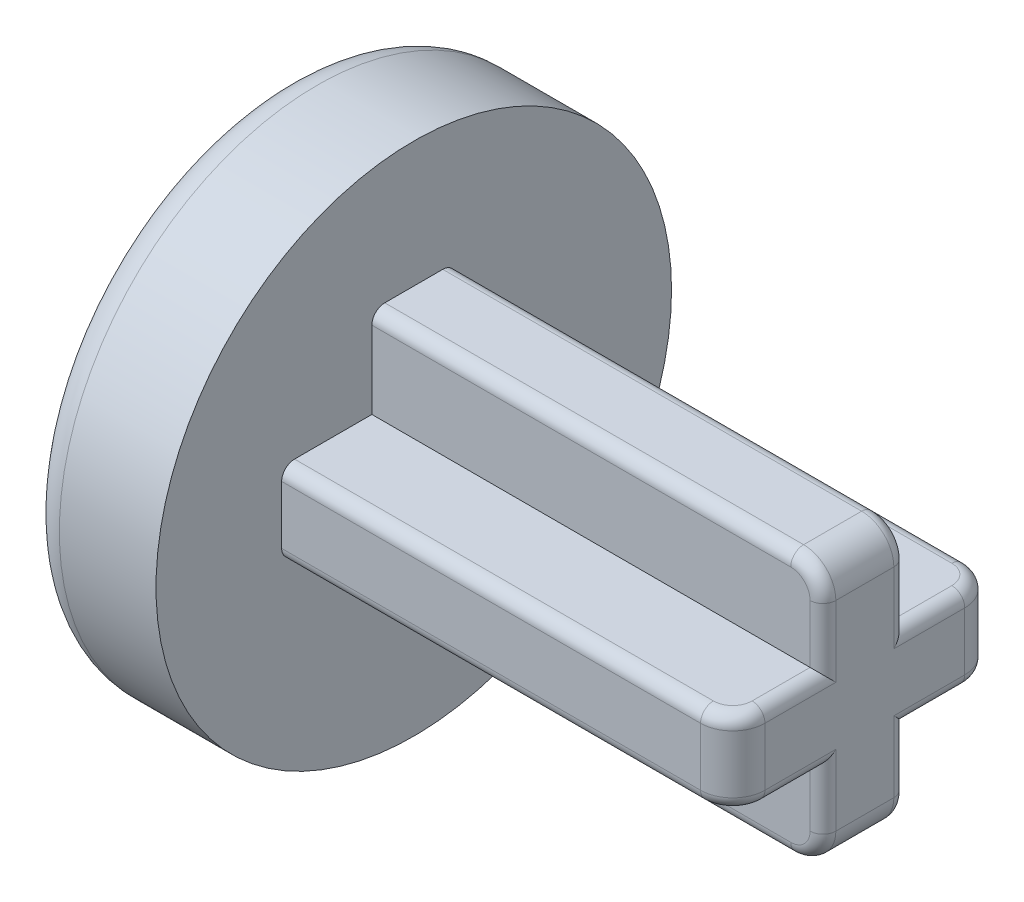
ISO-10303-21;
HEADER;
FILE_DESCRIPTION(('STEP AP214'),'2;1');
FILE_NAME('part.step','',(''),(''),'','','');
FILE_SCHEMA(('AUTOMOTIVE_DESIGN { 1 0 10303 214 1 1 1 1 }'));
ENDSEC;
DATA;
#1=APPLICATION_CONTEXT('core data for automotive mechanical design processes');
#2=APPLICATION_PROTOCOL_DEFINITION('international standard','automotive_design',2000,#1);
#3=PRODUCT_CONTEXT('',#1,'mechanical');
#4=PRODUCT('Part','Part','',(#3));
#5=PRODUCT_RELATED_PRODUCT_CATEGORY('part','',(#4));
#6=PRODUCT_DEFINITION_FORMATION('','',#4);
#7=PRODUCT_DEFINITION_CONTEXT('part definition',#1,'design');
#8=PRODUCT_DEFINITION('design','',#6,#7);
#9=PRODUCT_DEFINITION_SHAPE('','',#8);
#10=(LENGTH_UNIT() NAMED_UNIT(*) SI_UNIT(.MILLI.,.METRE.));
#11=(NAMED_UNIT(*) PLANE_ANGLE_UNIT() SI_UNIT($,.RADIAN.));
#12=(NAMED_UNIT(*) SI_UNIT($,.STERADIAN.) SOLID_ANGLE_UNIT());
#13=UNCERTAINTY_MEASURE_WITH_UNIT(LENGTH_MEASURE(1.E-05),#10,'distance_accuracy_value','');
#14=(GEOMETRIC_REPRESENTATION_CONTEXT(3) GLOBAL_UNCERTAINTY_ASSIGNED_CONTEXT((#13)) GLOBAL_UNIT_ASSIGNED_CONTEXT((#10,
#11,#12)) REPRESENTATION_CONTEXT('',''));
#15=CARTESIAN_POINT('',(0.,0.,0.));
#16=DIRECTION('',(0.,0.,1.));
#17=DIRECTION('',(1.,0.,0.));
#18=AXIS2_PLACEMENT_3D('',#15,#16,#17);
#19=CARTESIAN_POINT('',(2.,0.,0.));
#20=DIRECTION('',(1.,0.,0.));
#21=DIRECTION('',(0.,0.,-1.));
#22=AXIS2_PLACEMENT_3D('',#19,#20,#21);
#23=PLANE('',#22);
#24=CARTESIAN_POINT('',(2.,0.,0.));
#25=DIRECTION('',(1.,0.,0.));
#26=DIRECTION('',(0.,0.,-1.));
#27=AXIS2_PLACEMENT_3D('',#24,#25,#26);
#28=CIRCLE('',#27,4.);
#29=CARTESIAN_POINT('',(2.,0.,-4.));
#30=VERTEX_POINT('',#29);
#31=EDGE_CURVE('E242',#30,#30,#28,.T.);
#32=ORIENTED_EDGE('',*,*,#31,.T.);
#33=EDGE_LOOP('',(#32));
#34=FACE_BOUND('',#33,.T.);
#35=DIRECTION('',(0.,0.,1.));
#36=VECTOR('',#35,1.);
#37=CARTESIAN_POINT('',(2.,0.65,2.05));
#38=LINE('',#37,#36);
#39=CARTESIAN_POINT('',(2.,0.65,0.65));
#40=VERTEX_POINT('',#39);
#41=CARTESIAN_POINT('',(2.,0.65,1.85));
#42=VERTEX_POINT('',#41);
#43=EDGE_CURVE('E237',#40,#42,#38,.T.);
#44=ORIENTED_EDGE('',*,*,#43,.F.);
#45=DIRECTION('',(0.,-1.,0.));
#46=VECTOR('',#45,1.);
#47=CARTESIAN_POINT('',(2.,0.65,0.65));
#48=LINE('',#47,#46);
#49=CARTESIAN_POINT('',(2.,1.85,0.65));
#50=VERTEX_POINT('',#49);
#51=EDGE_CURVE('E246',#50,#40,#48,.T.);
#52=ORIENTED_EDGE('',*,*,#51,.F.);
#53=CARTESIAN_POINT('',(2.,1.85,0.45));
#54=DIRECTION('',(1.,0.,0.));
#55=DIRECTION('',(0.,0.,-1.));
#56=AXIS2_PLACEMENT_3D('',#53,#54,#55);
#57=CIRCLE('',#56,0.2);
#58=CARTESIAN_POINT('',(2.,2.05,0.45));
#59=VERTEX_POINT('',#58);
#60=EDGE_CURVE('E337',#50,#59,#57,.F.);
#61=ORIENTED_EDGE('',*,*,#60,.T.);
#62=DIRECTION('',(0.,0.,1.));
#63=VECTOR('',#62,1.);
#64=CARTESIAN_POINT('',(2.,2.05,0.65));
#65=LINE('',#64,#63);
#66=CARTESIAN_POINT('',(2.,2.05,-0.45));
#67=VERTEX_POINT('',#66);
#68=EDGE_CURVE('E286',#67,#59,#65,.T.);
#69=ORIENTED_EDGE('',*,*,#68,.F.);
#70=CARTESIAN_POINT('',(2.,1.85,-0.45));
#71=DIRECTION('',(1.,0.,0.));
#72=DIRECTION('',(0.,0.,-1.));
#73=AXIS2_PLACEMENT_3D('',#70,#71,#72);
#74=CIRCLE('',#73,0.2);
#75=CARTESIAN_POINT('',(2.,1.85,-0.65));
#76=VERTEX_POINT('',#75);
#77=EDGE_CURVE('E339',#67,#76,#74,.F.);
#78=ORIENTED_EDGE('',*,*,#77,.T.);
#79=DIRECTION('',(0.,1.,0.));
#80=VECTOR('',#79,1.);
#81=CARTESIAN_POINT('',(2.,2.05,-0.65));
#82=LINE('',#81,#80);
#83=CARTESIAN_POINT('',(2.,0.65,-0.65));
#84=VERTEX_POINT('',#83);
#85=EDGE_CURVE('E283',#84,#76,#82,.T.);
#86=ORIENTED_EDGE('',*,*,#85,.F.);
#87=DIRECTION('',(0.,0.,1.));
#88=VECTOR('',#87,1.);
#89=CARTESIAN_POINT('',(2.,0.65,-0.65));
#90=LINE('',#89,#88);
#91=CARTESIAN_POINT('',(2.,0.65,-1.85));
#92=VERTEX_POINT('',#91);
#93=EDGE_CURVE('E280',#92,#84,#90,.T.);
#94=ORIENTED_EDGE('',*,*,#93,.F.);
#95=CARTESIAN_POINT('',(2.,0.45,-1.85));
#96=DIRECTION('',(1.,0.,0.));
#97=DIRECTION('',(0.,0.,-1.));
#98=AXIS2_PLACEMENT_3D('',#95,#96,#97);
#99=CIRCLE('',#98,0.2);
#100=CARTESIAN_POINT('',(2.,0.45,-2.05));
#101=VERTEX_POINT('',#100);
#102=EDGE_CURVE('E341',#92,#101,#99,.F.);
#103=ORIENTED_EDGE('',*,*,#102,.T.);
#104=DIRECTION('',(0.,1.,0.));
#105=VECTOR('',#104,1.);
#106=CARTESIAN_POINT('',(2.,0.65,-2.05));
#107=LINE('',#106,#105);
#108=CARTESIAN_POINT('',(2.,-0.45,-2.05));
#109=VERTEX_POINT('',#108);
#110=EDGE_CURVE('E277',#109,#101,#107,.T.);
#111=ORIENTED_EDGE('',*,*,#110,.F.);
#112=CARTESIAN_POINT('',(2.,-0.45,-1.85));
#113=DIRECTION('',(1.,0.,0.));
#114=DIRECTION('',(0.,0.,-1.));
#115=AXIS2_PLACEMENT_3D('',#112,#113,#114);
#116=CIRCLE('',#115,0.2);
#117=CARTESIAN_POINT('',(2.,-0.65,-1.85));
#118=VERTEX_POINT('',#117);
#119=EDGE_CURVE('E343',#109,#118,#116,.F.);
#120=ORIENTED_EDGE('',*,*,#119,.T.);
#121=DIRECTION('',(0.,0.,-1.));
#122=VECTOR('',#121,1.);
#123=CARTESIAN_POINT('',(2.,-0.65,-2.05));
#124=LINE('',#123,#122);
#125=CARTESIAN_POINT('',(2.,-0.65,-0.65));
#126=VERTEX_POINT('',#125);
#127=EDGE_CURVE('E274',#126,#118,#124,.T.);
#128=ORIENTED_EDGE('',*,*,#127,.F.);
#129=DIRECTION('',(0.,1.,0.));
#130=VECTOR('',#129,1.);
#131=CARTESIAN_POINT('',(2.,-0.65,-0.65));
#132=LINE('',#131,#130);
#133=CARTESIAN_POINT('',(2.,-1.85,-0.65));
#134=VERTEX_POINT('',#133);
#135=EDGE_CURVE('E271',#134,#126,#132,.T.);
#136=ORIENTED_EDGE('',*,*,#135,.F.);
#137=CARTESIAN_POINT('',(2.,-1.85,-0.45));
#138=DIRECTION('',(1.,0.,0.));
#139=DIRECTION('',(0.,0.,-1.));
#140=AXIS2_PLACEMENT_3D('',#137,#138,#139);
#141=CIRCLE('',#140,0.2);
#142=CARTESIAN_POINT('',(2.,-2.05,-0.45));
#143=VERTEX_POINT('',#142);
#144=EDGE_CURVE('E345',#134,#143,#141,.F.);
#145=ORIENTED_EDGE('',*,*,#144,.T.);
#146=DIRECTION('',(0.,0.,-1.));
#147=VECTOR('',#146,1.);
#148=CARTESIAN_POINT('',(2.,-2.05,-0.65));
#149=LINE('',#148,#147);
#150=CARTESIAN_POINT('',(2.,-2.05,0.45));
#151=VERTEX_POINT('',#150);
#152=EDGE_CURVE('E268',#151,#143,#149,.T.);
#153=ORIENTED_EDGE('',*,*,#152,.F.);
#154=CARTESIAN_POINT('',(2.,-1.85,0.45));
#155=DIRECTION('',(1.,0.,0.));
#156=DIRECTION('',(0.,0.,-1.));
#157=AXIS2_PLACEMENT_3D('',#154,#155,#156);
#158=CIRCLE('',#157,0.2);
#159=CARTESIAN_POINT('',(2.,-1.85,0.65));
#160=VERTEX_POINT('',#159);
#161=EDGE_CURVE('E347',#151,#160,#158,.F.);
#162=ORIENTED_EDGE('',*,*,#161,.T.);
#163=DIRECTION('',(0.,-1.,0.));
#164=VECTOR('',#163,1.);
#165=CARTESIAN_POINT('',(2.,-2.05,0.65));
#166=LINE('',#165,#164);
#167=CARTESIAN_POINT('',(2.,-0.65,0.65));
#168=VERTEX_POINT('',#167);
#169=EDGE_CURVE('E265',#168,#160,#166,.T.);
#170=ORIENTED_EDGE('',*,*,#169,.F.);
#171=DIRECTION('',(0.,0.,-1.));
#172=VECTOR('',#171,1.);
#173=CARTESIAN_POINT('',(2.,-0.65,0.65));
#174=LINE('',#173,#172);
#175=CARTESIAN_POINT('',(2.,-0.65,1.85));
#176=VERTEX_POINT('',#175);
#177=EDGE_CURVE('E260',#176,#168,#174,.T.);
#178=ORIENTED_EDGE('',*,*,#177,.F.);
#179=CARTESIAN_POINT('',(2.,-0.45,1.85));
#180=DIRECTION('',(1.,0.,0.));
#181=DIRECTION('',(0.,0.,-1.));
#182=AXIS2_PLACEMENT_3D('',#179,#180,#181);
#183=CIRCLE('',#182,0.2);
#184=CARTESIAN_POINT('',(2.,-0.45,2.05));
#185=VERTEX_POINT('',#184);
#186=EDGE_CURVE('E334',#176,#185,#183,.F.);
#187=ORIENTED_EDGE('',*,*,#186,.T.);
#188=DIRECTION('',(0.,-1.,0.));
#189=VECTOR('',#188,1.);
#190=CARTESIAN_POINT('',(2.,-0.65,2.05));
#191=LINE('',#190,#189);
#192=CARTESIAN_POINT('',(2.,0.45,2.05));
#193=VERTEX_POINT('',#192);
#194=EDGE_CURVE('E257',#193,#185,#191,.T.);
#195=ORIENTED_EDGE('',*,*,#194,.F.);
#196=CARTESIAN_POINT('',(2.,0.45,1.85));
#197=DIRECTION('',(1.,0.,0.));
#198=DIRECTION('',(0.,0.,-1.));
#199=AXIS2_PLACEMENT_3D('',#196,#197,#198);
#200=CIRCLE('',#199,0.2);
#201=EDGE_CURVE('E256',#193,#42,#200,.F.);
#202=ORIENTED_EDGE('',*,*,#201,.T.);
#203=EDGE_LOOP('',(#44,#52,#61,#69,#78,#86,#94,#103,#111,#120,#128,#136,#145,#153,#162,#170,
#178,#187,#195,#202));
#204=FACE_BOUND('',#203,.T.);
#205=ADVANCED_FACE('F35',(#34,#204),#23,.T.);
#206=CARTESIAN_POINT('',(2.,0.,0.));
#207=DIRECTION('',(-1.,0.,0.));
#208=DIRECTION('',(0.,0.,1.));
#209=AXIS2_PLACEMENT_3D('',#206,#207,#208);
#210=CYLINDRICAL_SURFACE('',#209,4.);
#211=CARTESIAN_POINT('',(0.5,0.,0.));
#212=DIRECTION('',(1.,0.,0.));
#213=DIRECTION('',(0.,0.,-1.));
#214=AXIS2_PLACEMENT_3D('',#211,#212,#213);
#215=CIRCLE('',#214,4.);
#216=CARTESIAN_POINT('',(0.5,0.,-4.));
#217=VERTEX_POINT('',#216);
#218=EDGE_CURVE('E43',#217,#217,#215,.T.);
#219=ORIENTED_EDGE('',*,*,#218,.T.);
#220=EDGE_LOOP('',(#219));
#221=FACE_BOUND('',#220,.T.);
#222=ORIENTED_EDGE('',*,*,#31,.F.);
#223=EDGE_LOOP('',(#222));
#224=FACE_BOUND('',#223,.T.);
#225=ADVANCED_FACE('F490',(#221,#224),#210,.T.);
#226=CARTESIAN_POINT('',(0.,0.,0.));
#227=DIRECTION('',(1.,0.,0.));
#228=DIRECTION('',(0.,0.,-1.));
#229=AXIS2_PLACEMENT_3D('',#226,#227,#228);
#230=PLANE('',#229);
#231=CARTESIAN_POINT('',(0.,0.,0.));
#232=DIRECTION('',(1.,0.,0.));
#233=DIRECTION('',(0.,0.,-1.));
#234=AXIS2_PLACEMENT_3D('',#231,#232,#233);
#235=CIRCLE('',#234,3.5);
#236=CARTESIAN_POINT('',(0.,0.,-3.5));
#237=VERTEX_POINT('',#236);
#238=EDGE_CURVE('E11',#237,#237,#235,.F.);
#239=ORIENTED_EDGE('',*,*,#238,.T.);
#240=EDGE_LOOP('',(#239));
#241=FACE_BOUND('',#240,.T.);
#242=ADVANCED_FACE('F509',(#241),#230,.F.);
#243=CARTESIAN_POINT('',(9.,0.65,0.65));
#244=DIRECTION('',(0.,0.,-1.));
#245=DIRECTION('',(-1.,0.,0.));
#246=AXIS2_PLACEMENT_3D('',#243,#244,#245);
#247=PLANE('',#246);
#248=DIRECTION('',(-1.,0.,0.));
#249=VECTOR('',#248,1.);
#250=CARTESIAN_POINT('',(9.,0.65,0.65));
#251=LINE('',#250,#249);
#252=CARTESIAN_POINT('',(8.8,0.65,0.65));
#253=VERTEX_POINT('',#252);
#254=EDGE_CURVE('E233',#253,#40,#251,.T.);
#255=ORIENTED_EDGE('',*,*,#254,.F.);
#256=DIRECTION('',(0.,-1.,0.));
#257=VECTOR('',#256,1.);
#258=CARTESIAN_POINT('',(8.8,0.65,0.65));
#259=LINE('',#258,#257);
#260=CARTESIAN_POINT('',(8.8,1.55,0.65));
#261=VERTEX_POINT('',#260);
#262=EDGE_CURVE('E392',#253,#261,#259,.F.);
#263=ORIENTED_EDGE('',*,*,#262,.T.);
#264=CARTESIAN_POINT('',(8.5,1.55,0.65));
#265=DIRECTION('',(0.,0.,-1.));
#266=DIRECTION('',(-1.,0.,0.));
#267=AXIS2_PLACEMENT_3D('',#264,#265,#266);
#268=CIRCLE('',#267,0.3);
#269=CARTESIAN_POINT('',(8.5,1.85,0.65));
#270=VERTEX_POINT('',#269);
#271=EDGE_CURVE('E390',#261,#270,#268,.F.);
#272=ORIENTED_EDGE('',*,*,#271,.T.);
#273=DIRECTION('',(-1.,0.,0.));
#274=VECTOR('',#273,1.);
#275=CARTESIAN_POINT('',(9.,1.85,0.65));
#276=LINE('',#275,#274);
#277=EDGE_CURVE('E249',#270,#50,#276,.T.);
#278=ORIENTED_EDGE('',*,*,#277,.T.);
#279=ORIENTED_EDGE('',*,*,#51,.T.);
#280=EDGE_LOOP('',(#255,#263,#272,#278,#279));
#281=FACE_BOUND('',#280,.T.);
#282=ADVANCED_FACE('F247',(#281),#247,.F.);
#283=CARTESIAN_POINT('',(9.,0.65,2.05));
#284=DIRECTION('',(0.,-1.,0.));
#285=DIRECTION('',(0.,0.,-1.));
#286=AXIS2_PLACEMENT_3D('',#283,#284,#285);
#287=PLANE('',#286);
#288=DIRECTION('',(-1.,0.,0.));
#289=VECTOR('',#288,1.);
#290=CARTESIAN_POINT('',(9.,0.65,1.85));
#291=LINE('',#290,#289);
#292=CARTESIAN_POINT('',(8.5,0.65,1.85));
#293=VERTEX_POINT('',#292);
#294=EDGE_CURVE('E303',#42,#293,#291,.F.);
#295=ORIENTED_EDGE('',*,*,#294,.T.);
#296=CARTESIAN_POINT('',(8.5,0.65,1.55));
#297=DIRECTION('',(0.,-1.,0.));
#298=DIRECTION('',(0.,0.,-1.));
#299=AXIS2_PLACEMENT_3D('',#296,#297,#298);
#300=CIRCLE('',#299,0.3);
#301=CARTESIAN_POINT('',(8.8,0.65,1.55));
#302=VERTEX_POINT('',#301);
#303=EDGE_CURVE('E50',#293,#302,#300,.F.);
#304=ORIENTED_EDGE('',*,*,#303,.T.);
#305=DIRECTION('',(0.,0.,1.));
#306=VECTOR('',#305,1.);
#307=CARTESIAN_POINT('',(8.8,0.65,2.05));
#308=LINE('',#307,#306);
#309=EDGE_CURVE('E239',#302,#253,#308,.F.);
#310=ORIENTED_EDGE('',*,*,#309,.T.);
#311=ORIENTED_EDGE('',*,*,#254,.T.);
#312=ORIENTED_EDGE('',*,*,#43,.T.);
#313=EDGE_LOOP('',(#295,#304,#310,#311,#312));
#314=FACE_BOUND('',#313,.T.);
#315=ADVANCED_FACE('F235',(#314),#287,.F.);
#316=CARTESIAN_POINT('',(9.,-0.65,2.05));
#317=DIRECTION('',(0.,0.,-1.));
#318=DIRECTION('',(-1.,0.,0.));
#319=AXIS2_PLACEMENT_3D('',#316,#317,#318);
#320=PLANE('',#319);
#321=DIRECTION('',(-1.,0.,0.));
#322=VECTOR('',#321,1.);
#323=CARTESIAN_POINT('',(9.,-0.45,2.05));
#324=LINE('',#323,#322);
#325=CARTESIAN_POINT('',(8.5,-0.45,2.05));
#326=VERTEX_POINT('',#325);
#327=EDGE_CURVE('E300',#185,#326,#324,.F.);
#328=ORIENTED_EDGE('',*,*,#327,.T.);
#329=DIRECTION('',(0.,-1.,0.));
#330=VECTOR('',#329,1.);
#331=CARTESIAN_POINT('',(8.5,-0.65,2.05));
#332=LINE('',#331,#330);
#333=CARTESIAN_POINT('',(8.5,0.45,2.05));
#334=VERTEX_POINT('',#333);
#335=EDGE_CURVE('E364',#326,#334,#332,.F.);
#336=ORIENTED_EDGE('',*,*,#335,.T.);
#337=DIRECTION('',(-1.,0.,0.));
#338=VECTOR('',#337,1.);
#339=CARTESIAN_POINT('',(9.,0.45,2.05));
#340=LINE('',#339,#338);
#341=EDGE_CURVE('E298',#334,#193,#340,.T.);
#342=ORIENTED_EDGE('',*,*,#341,.T.);
#343=ORIENTED_EDGE('',*,*,#194,.T.);
#344=EDGE_LOOP('',(#328,#336,#342,#343));
#345=FACE_BOUND('',#344,.T.);
#346=ADVANCED_FACE('F633',(#345),#320,.F.);
#347=CARTESIAN_POINT('',(9.,-0.65,0.65));
#348=DIRECTION('',(0.,1.,0.));
#349=DIRECTION('',(0.,0.,1.));
#350=AXIS2_PLACEMENT_3D('',#347,#348,#349);
#351=PLANE('',#350);
#352=DIRECTION('',(0.,0.,-1.));
#353=VECTOR('',#352,1.);
#354=CARTESIAN_POINT('',(8.8,-0.65,0.65));
#355=LINE('',#354,#353);
#356=CARTESIAN_POINT('',(8.8,-0.65,0.65));
#357=VERTEX_POINT('',#356);
#358=CARTESIAN_POINT('',(8.8,-0.65,1.55));
#359=VERTEX_POINT('',#358);
#360=EDGE_CURVE('E441',#357,#359,#355,.F.);
#361=ORIENTED_EDGE('',*,*,#360,.T.);
#362=CARTESIAN_POINT('',(8.5,-0.65,1.55));
#363=DIRECTION('',(0.,1.,0.));
#364=DIRECTION('',(0.,0.,1.));
#365=AXIS2_PLACEMENT_3D('',#362,#363,#364);
#366=CIRCLE('',#365,0.3);
#367=CARTESIAN_POINT('',(8.5,-0.65,1.85));
#368=VERTEX_POINT('',#367);
#369=EDGE_CURVE('E443',#359,#368,#366,.F.);
#370=ORIENTED_EDGE('',*,*,#369,.T.);
#371=DIRECTION('',(-1.,0.,0.));
#372=VECTOR('',#371,1.);
#373=CARTESIAN_POINT('',(9.,-0.65,1.85));
#374=LINE('',#373,#372);
#375=EDGE_CURVE('E296',#368,#176,#374,.T.);
#376=ORIENTED_EDGE('',*,*,#375,.T.);
#377=ORIENTED_EDGE('',*,*,#177,.T.);
#378=DIRECTION('',(-1.,0.,0.));
#379=VECTOR('',#378,1.);
#380=CARTESIAN_POINT('',(9.,-0.65,0.65));
#381=LINE('',#380,#379);
#382=EDGE_CURVE('E243',#357,#168,#381,.T.);
#383=ORIENTED_EDGE('',*,*,#382,.F.);
#384=EDGE_LOOP('',(#361,#370,#376,#377,#383));
#385=FACE_BOUND('',#384,.T.);
#386=ADVANCED_FACE('F724',(#385),#351,.F.);
#387=CARTESIAN_POINT('',(9.,-2.05,0.65));
#388=DIRECTION('',(0.,0.,-1.));
#389=DIRECTION('',(-1.,0.,0.));
#390=AXIS2_PLACEMENT_3D('',#387,#388,#389);
#391=PLANE('',#390);
#392=DIRECTION('',(-1.,0.,0.));
#393=VECTOR('',#392,1.);
#394=CARTESIAN_POINT('',(9.,-1.85,0.65));
#395=LINE('',#394,#393);
#396=CARTESIAN_POINT('',(8.5,-1.85,0.65));
#397=VERTEX_POINT('',#396);
#398=EDGE_CURVE('E331',#160,#397,#395,.F.);
#399=ORIENTED_EDGE('',*,*,#398,.T.);
#400=CARTESIAN_POINT('',(8.5,-1.55,0.65));
#401=DIRECTION('',(0.,0.,-1.));
#402=DIRECTION('',(-1.,0.,0.));
#403=AXIS2_PLACEMENT_3D('',#400,#401,#402);
#404=CIRCLE('',#403,0.3);
#405=CARTESIAN_POINT('',(8.8,-1.55,0.65));
#406=VERTEX_POINT('',#405);
#407=EDGE_CURVE('E439',#397,#406,#404,.F.);
#408=ORIENTED_EDGE('',*,*,#407,.T.);
#409=DIRECTION('',(0.,-1.,0.));
#410=VECTOR('',#409,1.);
#411=CARTESIAN_POINT('',(8.8,-2.05,0.65));
#412=LINE('',#411,#410);
#413=EDGE_CURVE('E437',#406,#357,#412,.F.);
#414=ORIENTED_EDGE('',*,*,#413,.T.);
#415=ORIENTED_EDGE('',*,*,#382,.T.);
#416=ORIENTED_EDGE('',*,*,#169,.T.);
#417=EDGE_LOOP('',(#399,#408,#414,#415,#416));
#418=FACE_BOUND('',#417,.T.);
#419=ADVANCED_FACE('F719',(#418),#391,.F.);
#420=CARTESIAN_POINT('',(9.,-2.05,-0.65));
#421=DIRECTION('',(0.,1.,0.));
#422=DIRECTION('',(0.,0.,1.));
#423=AXIS2_PLACEMENT_3D('',#420,#421,#422);
#424=PLANE('',#423);
#425=DIRECTION('',(-1.,0.,0.));
#426=VECTOR('',#425,1.);
#427=CARTESIAN_POINT('',(9.,-2.05,-0.45));
#428=LINE('',#427,#426);
#429=CARTESIAN_POINT('',(8.5,-2.05,-0.45));
#430=VERTEX_POINT('',#429);
#431=EDGE_CURVE('E328',#143,#430,#428,.F.);
#432=ORIENTED_EDGE('',*,*,#431,.T.);
#433=DIRECTION('',(0.,0.,-1.));
#434=VECTOR('',#433,1.);
#435=CARTESIAN_POINT('',(8.5,-2.05,-0.65));
#436=LINE('',#435,#434);
#437=CARTESIAN_POINT('',(8.5,-2.05,0.45));
#438=VERTEX_POINT('',#437);
#439=EDGE_CURVE('E370',#430,#438,#436,.F.);
#440=ORIENTED_EDGE('',*,*,#439,.T.);
#441=DIRECTION('',(-1.,0.,0.));
#442=VECTOR('',#441,1.);
#443=CARTESIAN_POINT('',(9.,-2.05,0.45));
#444=LINE('',#443,#442);
#445=EDGE_CURVE('E326',#438,#151,#444,.T.);
#446=ORIENTED_EDGE('',*,*,#445,.T.);
#447=ORIENTED_EDGE('',*,*,#152,.T.);
#448=EDGE_LOOP('',(#432,#440,#446,#447));
#449=FACE_BOUND('',#448,.T.);
#450=ADVANCED_FACE('F704',(#449),#424,.F.);
#451=CARTESIAN_POINT('',(9.,-0.65,-0.65));
#452=DIRECTION('',(0.,0.,1.));
#453=DIRECTION('',(1.,0.,0.));
#454=AXIS2_PLACEMENT_3D('',#451,#452,#453);
#455=PLANE('',#454);
#456=DIRECTION('',(0.,1.,0.));
#457=VECTOR('',#456,1.);
#458=CARTESIAN_POINT('',(8.8,-0.65,-0.65));
#459=LINE('',#458,#457);
#460=CARTESIAN_POINT('',(8.8,-0.65,-0.65));
#461=VERTEX_POINT('',#460);
#462=CARTESIAN_POINT('',(8.8,-1.55,-0.65));
#463=VERTEX_POINT('',#462);
#464=EDGE_CURVE('E424',#461,#463,#459,.F.);
#465=ORIENTED_EDGE('',*,*,#464,.T.);
#466=CARTESIAN_POINT('',(8.5,-1.55,-0.65));
#467=DIRECTION('',(0.,0.,1.));
#468=DIRECTION('',(1.,0.,0.));
#469=AXIS2_PLACEMENT_3D('',#466,#467,#468);
#470=CIRCLE('',#469,0.3);
#471=CARTESIAN_POINT('',(8.5,-1.85,-0.65));
#472=VERTEX_POINT('',#471);
#473=EDGE_CURVE('E426',#463,#472,#470,.F.);
#474=ORIENTED_EDGE('',*,*,#473,.T.);
#475=DIRECTION('',(-1.,0.,0.));
#476=VECTOR('',#475,1.);
#477=CARTESIAN_POINT('',(9.,-1.85,-0.65));
#478=LINE('',#477,#476);
#479=EDGE_CURVE('E324',#472,#134,#478,.T.);
#480=ORIENTED_EDGE('',*,*,#479,.T.);
#481=ORIENTED_EDGE('',*,*,#135,.T.);
#482=DIRECTION('',(-1.,0.,0.));
#483=VECTOR('',#482,1.);
#484=CARTESIAN_POINT('',(9.,-0.65,-0.65));
#485=LINE('',#484,#483);
#486=EDGE_CURVE('E291',#461,#126,#485,.T.);
#487=ORIENTED_EDGE('',*,*,#486,.F.);
#488=EDGE_LOOP('',(#465,#474,#480,#481,#487));
#489=FACE_BOUND('',#488,.T.);
#490=ADVANCED_FACE('F696',(#489),#455,.F.);
#491=CARTESIAN_POINT('',(9.,-0.65,-2.05));
#492=DIRECTION('',(0.,1.,0.));
#493=DIRECTION('',(0.,0.,1.));
#494=AXIS2_PLACEMENT_3D('',#491,#492,#493);
#495=PLANE('',#494);
#496=DIRECTION('',(-1.,0.,0.));
#497=VECTOR('',#496,1.);
#498=CARTESIAN_POINT('',(9.,-0.65,-1.85));
#499=LINE('',#498,#497);
#500=CARTESIAN_POINT('',(8.5,-0.65,-1.85));
#501=VERTEX_POINT('',#500);
#502=EDGE_CURVE('E321',#118,#501,#499,.F.);
#503=ORIENTED_EDGE('',*,*,#502,.T.);
#504=CARTESIAN_POINT('',(8.5,-0.65,-1.55));
#505=DIRECTION('',(0.,1.,0.));
#506=DIRECTION('',(0.,0.,1.));
#507=AXIS2_PLACEMENT_3D('',#504,#505,#506);
#508=CIRCLE('',#507,0.3);
#509=CARTESIAN_POINT('',(8.8,-0.65,-1.55));
#510=VERTEX_POINT('',#509);
#511=EDGE_CURVE('E422',#501,#510,#508,.F.);
#512=ORIENTED_EDGE('',*,*,#511,.T.);
#513=DIRECTION('',(0.,0.,-1.));
#514=VECTOR('',#513,1.);
#515=CARTESIAN_POINT('',(8.8,-0.65,-2.05));
#516=LINE('',#515,#514);
#517=EDGE_CURVE('E420',#510,#461,#516,.F.);
#518=ORIENTED_EDGE('',*,*,#517,.T.);
#519=ORIENTED_EDGE('',*,*,#486,.T.);
#520=ORIENTED_EDGE('',*,*,#127,.T.);
#521=EDGE_LOOP('',(#503,#512,#518,#519,#520));
#522=FACE_BOUND('',#521,.T.);
#523=ADVANCED_FACE('F689',(#522),#495,.F.);
#524=CARTESIAN_POINT('',(9.,0.65,-2.05));
#525=DIRECTION('',(0.,0.,1.));
#526=DIRECTION('',(1.,0.,0.));
#527=AXIS2_PLACEMENT_3D('',#524,#525,#526);
#528=PLANE('',#527);
#529=DIRECTION('',(-1.,0.,0.));
#530=VECTOR('',#529,1.);
#531=CARTESIAN_POINT('',(9.,0.45,-2.05));
#532=LINE('',#531,#530);
#533=CARTESIAN_POINT('',(8.5,0.45,-2.05));
#534=VERTEX_POINT('',#533);
#535=EDGE_CURVE('E318',#101,#534,#532,.F.);
#536=ORIENTED_EDGE('',*,*,#535,.T.);
#537=DIRECTION('',(0.,1.,0.));
#538=VECTOR('',#537,1.);
#539=CARTESIAN_POINT('',(8.5,0.65,-2.05));
#540=LINE('',#539,#538);
#541=CARTESIAN_POINT('',(8.5,-0.45,-2.05));
#542=VERTEX_POINT('',#541);
#543=EDGE_CURVE('E367',#534,#542,#540,.F.);
#544=ORIENTED_EDGE('',*,*,#543,.T.);
#545=DIRECTION('',(-1.,0.,0.));
#546=VECTOR('',#545,1.);
#547=CARTESIAN_POINT('',(9.,-0.45,-2.05));
#548=LINE('',#547,#546);
#549=EDGE_CURVE('E316',#542,#109,#548,.T.);
#550=ORIENTED_EDGE('',*,*,#549,.T.);
#551=ORIENTED_EDGE('',*,*,#110,.T.);
#552=EDGE_LOOP('',(#536,#544,#550,#551));
#553=FACE_BOUND('',#552,.T.);
#554=ADVANCED_FACE('F672',(#553),#528,.F.);
#555=CARTESIAN_POINT('',(9.,0.65,-0.65));
#556=DIRECTION('',(0.,-1.,0.));
#557=DIRECTION('',(0.,0.,-1.));
#558=AXIS2_PLACEMENT_3D('',#555,#556,#557);
#559=PLANE('',#558);
#560=DIRECTION('',(0.,0.,1.));
#561=VECTOR('',#560,1.);
#562=CARTESIAN_POINT('',(8.8,0.65,-0.65));
#563=LINE('',#562,#561);
#564=CARTESIAN_POINT('',(8.8,0.65,-0.65));
#565=VERTEX_POINT('',#564);
#566=CARTESIAN_POINT('',(8.8,0.65,-1.55));
#567=VERTEX_POINT('',#566);
#568=EDGE_CURVE('E407',#565,#567,#563,.F.);
#569=ORIENTED_EDGE('',*,*,#568,.T.);
#570=CARTESIAN_POINT('',(8.5,0.65,-1.55));
#571=DIRECTION('',(0.,-1.,0.));
#572=DIRECTION('',(0.,0.,-1.));
#573=AXIS2_PLACEMENT_3D('',#570,#571,#572);
#574=CIRCLE('',#573,0.3);
#575=CARTESIAN_POINT('',(8.5,0.65,-1.85));
#576=VERTEX_POINT('',#575);
#577=EDGE_CURVE('E409',#567,#576,#574,.F.);
#578=ORIENTED_EDGE('',*,*,#577,.T.);
#579=DIRECTION('',(-1.,0.,0.));
#580=VECTOR('',#579,1.);
#581=CARTESIAN_POINT('',(9.,0.65,-1.85));
#582=LINE('',#581,#580);
#583=EDGE_CURVE('E314',#576,#92,#582,.T.);
#584=ORIENTED_EDGE('',*,*,#583,.T.);
#585=ORIENTED_EDGE('',*,*,#93,.T.);
#586=DIRECTION('',(-1.,0.,0.));
#587=VECTOR('',#586,1.);
#588=CARTESIAN_POINT('',(9.,0.65,-0.65));
#589=LINE('',#588,#587);
#590=EDGE_CURVE('E289',#565,#84,#589,.T.);
#591=ORIENTED_EDGE('',*,*,#590,.F.);
#592=EDGE_LOOP('',(#569,#578,#584,#585,#591));
#593=FACE_BOUND('',#592,.T.);
#594=ADVANCED_FACE('F664',(#593),#559,.F.);
#595=CARTESIAN_POINT('',(9.,2.05,-0.65));
#596=DIRECTION('',(0.,0.,1.));
#597=DIRECTION('',(1.,0.,0.));
#598=AXIS2_PLACEMENT_3D('',#595,#596,#597);
#599=PLANE('',#598);
#600=DIRECTION('',(-1.,0.,0.));
#601=VECTOR('',#600,1.);
#602=CARTESIAN_POINT('',(9.,1.85,-0.65));
#603=LINE('',#602,#601);
#604=CARTESIAN_POINT('',(8.5,1.85,-0.65));
#605=VERTEX_POINT('',#604);
#606=EDGE_CURVE('E311',#76,#605,#603,.F.);
#607=ORIENTED_EDGE('',*,*,#606,.T.);
#608=CARTESIAN_POINT('',(8.5,1.55,-0.65));
#609=DIRECTION('',(0.,0.,1.));
#610=DIRECTION('',(1.,0.,0.));
#611=AXIS2_PLACEMENT_3D('',#608,#609,#610);
#612=CIRCLE('',#611,0.3);
#613=CARTESIAN_POINT('',(8.8,1.55,-0.65));
#614=VERTEX_POINT('',#613);
#615=EDGE_CURVE('E405',#605,#614,#612,.F.);
#616=ORIENTED_EDGE('',*,*,#615,.T.);
#617=DIRECTION('',(0.,1.,0.));
#618=VECTOR('',#617,1.);
#619=CARTESIAN_POINT('',(8.8,2.05,-0.65));
#620=LINE('',#619,#618);
#621=EDGE_CURVE('E403',#614,#565,#620,.F.);
#622=ORIENTED_EDGE('',*,*,#621,.T.);
#623=ORIENTED_EDGE('',*,*,#590,.T.);
#624=ORIENTED_EDGE('',*,*,#85,.T.);
#625=EDGE_LOOP('',(#607,#616,#622,#623,#624));
#626=FACE_BOUND('',#625,.T.);
#627=ADVANCED_FACE('F656',(#626),#599,.F.);
#628=CARTESIAN_POINT('',(9.,2.05,0.65));
#629=DIRECTION('',(0.,-1.,0.));
#630=DIRECTION('',(0.,0.,-1.));
#631=AXIS2_PLACEMENT_3D('',#628,#629,#630);
#632=PLANE('',#631);
#633=DIRECTION('',(-1.,0.,0.));
#634=VECTOR('',#633,1.);
#635=CARTESIAN_POINT('',(9.,2.05,0.45));
#636=LINE('',#635,#634);
#637=CARTESIAN_POINT('',(8.5,2.05,0.45));
#638=VERTEX_POINT('',#637);
#639=EDGE_CURVE('E308',#59,#638,#636,.F.);
#640=ORIENTED_EDGE('',*,*,#639,.T.);
#641=DIRECTION('',(0.,0.,1.));
#642=VECTOR('',#641,1.);
#643=CARTESIAN_POINT('',(8.5,2.05,0.65));
#644=LINE('',#643,#642);
#645=CARTESIAN_POINT('',(8.5,2.05,-0.45));
#646=VERTEX_POINT('',#645);
#647=EDGE_CURVE('E361',#638,#646,#644,.F.);
#648=ORIENTED_EDGE('',*,*,#647,.T.);
#649=DIRECTION('',(-1.,0.,0.));
#650=VECTOR('',#649,1.);
#651=CARTESIAN_POINT('',(9.,2.05,-0.45));
#652=LINE('',#651,#650);
#653=EDGE_CURVE('E306',#646,#67,#652,.T.);
#654=ORIENTED_EDGE('',*,*,#653,.T.);
#655=ORIENTED_EDGE('',*,*,#68,.T.);
#656=EDGE_LOOP('',(#640,#648,#654,#655));
#657=FACE_BOUND('',#656,.T.);
#658=ADVANCED_FACE('F646',(#657),#632,.F.);
#659=CARTESIAN_POINT('',(9.,0.,0.));
#660=DIRECTION('',(-1.,0.,0.));
#661=DIRECTION('',(0.,0.,1.));
#662=AXIS2_PLACEMENT_3D('',#659,#660,#661);
#663=PLANE('',#662);
#664=DIRECTION('',(0.,0.,1.));
#665=VECTOR('',#664,1.);
#666=CARTESIAN_POINT('',(9.,1.55,0.));
#667=LINE('',#666,#665);
#668=CARTESIAN_POINT('',(9.,1.55,-0.45));
#669=VERTEX_POINT('',#668);
#670=CARTESIAN_POINT('',(9.,1.55,0.45));
#671=VERTEX_POINT('',#670);
#672=EDGE_CURVE('E358',#669,#671,#667,.T.);
#673=ORIENTED_EDGE('',*,*,#672,.T.);
#674=DIRECTION('',(0.,-1.,0.));
#675=VECTOR('',#674,1.);
#676=CARTESIAN_POINT('',(9.,0.,0.45));
#677=LINE('',#676,#675);
#678=CARTESIAN_POINT('',(9.,0.45,0.45));
#679=VERTEX_POINT('',#678);
#680=EDGE_CURVE('E387',#671,#679,#677,.T.);
#681=ORIENTED_EDGE('',*,*,#680,.T.);
#682=DIRECTION('',(0.,0.,1.));
#683=VECTOR('',#682,1.);
#684=CARTESIAN_POINT('',(9.,0.45,0.));
#685=LINE('',#684,#683);
#686=CARTESIAN_POINT('',(9.,0.45,1.55));
#687=VERTEX_POINT('',#686);
#688=EDGE_CURVE('E385',#679,#687,#685,.T.);
#689=ORIENTED_EDGE('',*,*,#688,.T.);
#690=DIRECTION('',(0.,-1.,0.));
#691=VECTOR('',#690,1.);
#692=CARTESIAN_POINT('',(9.,0.,1.55));
#693=LINE('',#692,#691);
#694=CARTESIAN_POINT('',(9.,-0.45,1.55));
#695=VERTEX_POINT('',#694);
#696=EDGE_CURVE('E355',#687,#695,#693,.T.);
#697=ORIENTED_EDGE('',*,*,#696,.T.);
#698=DIRECTION('',(0.,0.,-1.));
#699=VECTOR('',#698,1.);
#700=CARTESIAN_POINT('',(9.,-0.45,0.));
#701=LINE('',#700,#699);
#702=CARTESIAN_POINT('',(9.,-0.45,0.45));
#703=VERTEX_POINT('',#702);
#704=EDGE_CURVE('E383',#695,#703,#701,.T.);
#705=ORIENTED_EDGE('',*,*,#704,.T.);
#706=DIRECTION('',(0.,-1.,0.));
#707=VECTOR('',#706,1.);
#708=CARTESIAN_POINT('',(9.,0.,0.45));
#709=LINE('',#708,#707);
#710=CARTESIAN_POINT('',(9.,-1.55,0.45));
#711=VERTEX_POINT('',#710);
#712=EDGE_CURVE('E381',#703,#711,#709,.T.);
#713=ORIENTED_EDGE('',*,*,#712,.T.);
#714=DIRECTION('',(0.,0.,-1.));
#715=VECTOR('',#714,1.);
#716=CARTESIAN_POINT('',(9.,-1.55,0.));
#717=LINE('',#716,#715);
#718=CARTESIAN_POINT('',(9.,-1.55,-0.45));
#719=VERTEX_POINT('',#718);
#720=EDGE_CURVE('E349',#711,#719,#717,.T.);
#721=ORIENTED_EDGE('',*,*,#720,.T.);
#722=DIRECTION('',(0.,1.,0.));
#723=VECTOR('',#722,1.);
#724=CARTESIAN_POINT('',(9.,0.,-0.45));
#725=LINE('',#724,#723);
#726=CARTESIAN_POINT('',(9.,-0.45,-0.45));
#727=VERTEX_POINT('',#726);
#728=EDGE_CURVE('E379',#719,#727,#725,.T.);
#729=ORIENTED_EDGE('',*,*,#728,.T.);
#730=DIRECTION('',(0.,0.,-1.));
#731=VECTOR('',#730,1.);
#732=CARTESIAN_POINT('',(9.,-0.45,0.));
#733=LINE('',#732,#731);
#734=CARTESIAN_POINT('',(9.,-0.45,-1.55));
#735=VERTEX_POINT('',#734);
#736=EDGE_CURVE('E377',#727,#735,#733,.T.);
#737=ORIENTED_EDGE('',*,*,#736,.T.);
#738=DIRECTION('',(0.,1.,0.));
#739=VECTOR('',#738,1.);
#740=CARTESIAN_POINT('',(9.,0.,-1.55));
#741=LINE('',#740,#739);
#742=CARTESIAN_POINT('',(9.,0.45,-1.55));
#743=VERTEX_POINT('',#742);
#744=EDGE_CURVE('E352',#735,#743,#741,.T.);
#745=ORIENTED_EDGE('',*,*,#744,.T.);
#746=DIRECTION('',(0.,0.,1.));
#747=VECTOR('',#746,1.);
#748=CARTESIAN_POINT('',(9.,0.45,0.));
#749=LINE('',#748,#747);
#750=CARTESIAN_POINT('',(9.,0.45,-0.45));
#751=VERTEX_POINT('',#750);
#752=EDGE_CURVE('E373',#743,#751,#749,.T.);
#753=ORIENTED_EDGE('',*,*,#752,.T.);
#754=DIRECTION('',(0.,1.,0.));
#755=VECTOR('',#754,1.);
#756=CARTESIAN_POINT('',(9.,0.,-0.45));
#757=LINE('',#756,#755);
#758=EDGE_CURVE('E375',#751,#669,#757,.T.);
#759=ORIENTED_EDGE('',*,*,#758,.T.);
#760=EDGE_LOOP('',(#673,#681,#689,#697,#705,#713,#721,#729,#737,#745,#753,#759));
#761=FACE_BOUND('',#760,.T.);
#762=ADVANCED_FACE('F521',(#761),#663,.F.);
#763=CARTESIAN_POINT('',(9.,-0.45,1.85));
#764=DIRECTION('',(-1.,0.,0.));
#765=DIRECTION('',(0.,0.,1.));
#766=AXIS2_PLACEMENT_3D('',#763,#764,#765);
#767=CYLINDRICAL_SURFACE('',#766,0.2);
#768=ORIENTED_EDGE('',*,*,#375,.F.);
#769=CARTESIAN_POINT('',(8.5,-0.45,1.85));
#770=DIRECTION('',(-1.,0.,0.));
#771=DIRECTION('',(0.,0.,1.));
#772=AXIS2_PLACEMENT_3D('',#769,#770,#771);
#773=CIRCLE('',#772,0.2);
#774=EDGE_CURVE('E449',#368,#326,#773,.T.);
#775=ORIENTED_EDGE('',*,*,#774,.T.);
#776=ORIENTED_EDGE('',*,*,#327,.F.);
#777=ORIENTED_EDGE('',*,*,#186,.F.);
#778=EDGE_LOOP('',(#768,#775,#776,#777));
#779=FACE_BOUND('',#778,.T.);
#780=ADVANCED_FACE('F517',(#779),#767,.T.);
#781=CARTESIAN_POINT('',(9.,0.45,1.85));
#782=DIRECTION('',(-1.,0.,0.));
#783=DIRECTION('',(0.,0.,1.));
#784=AXIS2_PLACEMENT_3D('',#781,#782,#783);
#785=CYLINDRICAL_SURFACE('',#784,0.2);
#786=ORIENTED_EDGE('',*,*,#341,.F.);
#787=CARTESIAN_POINT('',(8.5,0.45,1.85));
#788=DIRECTION('',(-1.,0.,0.));
#789=DIRECTION('',(0.,0.,1.));
#790=AXIS2_PLACEMENT_3D('',#787,#788,#789);
#791=CIRCLE('',#790,0.2);
#792=EDGE_CURVE('E58',#334,#293,#791,.T.);
#793=ORIENTED_EDGE('',*,*,#792,.T.);
#794=ORIENTED_EDGE('',*,*,#294,.F.);
#795=ORIENTED_EDGE('',*,*,#201,.F.);
#796=EDGE_LOOP('',(#786,#793,#794,#795));
#797=FACE_BOUND('',#796,.T.);
#798=ADVANCED_FACE('F520',(#797),#785,.T.);
#799=CARTESIAN_POINT('',(9.,1.85,0.45));
#800=DIRECTION('',(-1.,0.,0.));
#801=DIRECTION('',(0.,0.,1.));
#802=AXIS2_PLACEMENT_3D('',#799,#800,#801);
#803=CYLINDRICAL_SURFACE('',#802,0.2);
#804=ORIENTED_EDGE('',*,*,#277,.F.);
#805=CARTESIAN_POINT('',(8.5,1.85,0.45));
#806=DIRECTION('',(-1.,0.,0.));
#807=DIRECTION('',(0.,0.,1.));
#808=AXIS2_PLACEMENT_3D('',#805,#806,#807);
#809=CIRCLE('',#808,0.2);
#810=EDGE_CURVE('E398',#270,#638,#809,.T.);
#811=ORIENTED_EDGE('',*,*,#810,.T.);
#812=ORIENTED_EDGE('',*,*,#639,.F.);
#813=ORIENTED_EDGE('',*,*,#60,.F.);
#814=EDGE_LOOP('',(#804,#811,#812,#813));
#815=FACE_BOUND('',#814,.T.);
#816=ADVANCED_FACE('F525',(#815),#803,.T.);
#817=CARTESIAN_POINT('',(9.,1.85,-0.45));
#818=DIRECTION('',(-1.,0.,0.));
#819=DIRECTION('',(0.,0.,1.));
#820=AXIS2_PLACEMENT_3D('',#817,#818,#819);
#821=CYLINDRICAL_SURFACE('',#820,0.2);
#822=ORIENTED_EDGE('',*,*,#653,.F.);
#823=CARTESIAN_POINT('',(8.5,1.85,-0.45));
#824=DIRECTION('',(-1.,0.,0.));
#825=DIRECTION('',(0.,0.,1.));
#826=AXIS2_PLACEMENT_3D('',#823,#824,#825);
#827=CIRCLE('',#826,0.2);
#828=EDGE_CURVE('E400',#646,#605,#827,.T.);
#829=ORIENTED_EDGE('',*,*,#828,.T.);
#830=ORIENTED_EDGE('',*,*,#606,.F.);
#831=ORIENTED_EDGE('',*,*,#77,.F.);
#832=EDGE_LOOP('',(#822,#829,#830,#831));
#833=FACE_BOUND('',#832,.T.);
#834=ADVANCED_FACE('F528',(#833),#821,.T.);
#835=CARTESIAN_POINT('',(9.,0.45,-1.85));
#836=DIRECTION('',(-1.,0.,0.));
#837=DIRECTION('',(0.,0.,1.));
#838=AXIS2_PLACEMENT_3D('',#835,#836,#837);
#839=CYLINDRICAL_SURFACE('',#838,0.2);
#840=ORIENTED_EDGE('',*,*,#583,.F.);
#841=CARTESIAN_POINT('',(8.5,0.45,-1.85));
#842=DIRECTION('',(-1.,0.,0.));
#843=DIRECTION('',(0.,0.,1.));
#844=AXIS2_PLACEMENT_3D('',#841,#842,#843);
#845=CIRCLE('',#844,0.2);
#846=EDGE_CURVE('E415',#576,#534,#845,.T.);
#847=ORIENTED_EDGE('',*,*,#846,.T.);
#848=ORIENTED_EDGE('',*,*,#535,.F.);
#849=ORIENTED_EDGE('',*,*,#102,.F.);
#850=EDGE_LOOP('',(#840,#847,#848,#849));
#851=FACE_BOUND('',#850,.T.);
#852=ADVANCED_FACE('F532',(#851),#839,.T.);
#853=CARTESIAN_POINT('',(9.,-0.45,-1.85));
#854=DIRECTION('',(-1.,0.,0.));
#855=DIRECTION('',(0.,0.,1.));
#856=AXIS2_PLACEMENT_3D('',#853,#854,#855);
#857=CYLINDRICAL_SURFACE('',#856,0.2);
#858=ORIENTED_EDGE('',*,*,#549,.F.);
#859=CARTESIAN_POINT('',(8.5,-0.45,-1.85));
#860=DIRECTION('',(-1.,0.,0.));
#861=DIRECTION('',(0.,0.,1.));
#862=AXIS2_PLACEMENT_3D('',#859,#860,#861);
#863=CIRCLE('',#862,0.2);
#864=EDGE_CURVE('E417',#542,#501,#863,.T.);
#865=ORIENTED_EDGE('',*,*,#864,.T.);
#866=ORIENTED_EDGE('',*,*,#502,.F.);
#867=ORIENTED_EDGE('',*,*,#119,.F.);
#868=EDGE_LOOP('',(#858,#865,#866,#867));
#869=FACE_BOUND('',#868,.T.);
#870=ADVANCED_FACE('F536',(#869),#857,.T.);
#871=CARTESIAN_POINT('',(9.,-1.85,-0.45));
#872=DIRECTION('',(-1.,0.,0.));
#873=DIRECTION('',(0.,0.,1.));
#874=AXIS2_PLACEMENT_3D('',#871,#872,#873);
#875=CYLINDRICAL_SURFACE('',#874,0.2);
#876=ORIENTED_EDGE('',*,*,#479,.F.);
#877=CARTESIAN_POINT('',(8.5,-1.85,-0.45));
#878=DIRECTION('',(-1.,0.,0.));
#879=DIRECTION('',(0.,0.,1.));
#880=AXIS2_PLACEMENT_3D('',#877,#878,#879);
#881=CIRCLE('',#880,0.2);
#882=EDGE_CURVE('E432',#472,#430,#881,.T.);
#883=ORIENTED_EDGE('',*,*,#882,.T.);
#884=ORIENTED_EDGE('',*,*,#431,.F.);
#885=ORIENTED_EDGE('',*,*,#144,.F.);
#886=EDGE_LOOP('',(#876,#883,#884,#885));
#887=FACE_BOUND('',#886,.T.);
#888=ADVANCED_FACE('F540',(#887),#875,.T.);
#889=CARTESIAN_POINT('',(9.,-1.85,0.45));
#890=DIRECTION('',(-1.,0.,0.));
#891=DIRECTION('',(0.,0.,1.));
#892=AXIS2_PLACEMENT_3D('',#889,#890,#891);
#893=CYLINDRICAL_SURFACE('',#892,0.2);
#894=ORIENTED_EDGE('',*,*,#445,.F.);
#895=CARTESIAN_POINT('',(8.5,-1.85,0.45));
#896=DIRECTION('',(-1.,0.,0.));
#897=DIRECTION('',(0.,0.,1.));
#898=AXIS2_PLACEMENT_3D('',#895,#896,#897);
#899=CIRCLE('',#898,0.2);
#900=EDGE_CURVE('E434',#438,#397,#899,.T.);
#901=ORIENTED_EDGE('',*,*,#900,.T.);
#902=ORIENTED_EDGE('',*,*,#398,.F.);
#903=ORIENTED_EDGE('',*,*,#161,.F.);
#904=EDGE_LOOP('',(#894,#901,#902,#903));
#905=FACE_BOUND('',#904,.T.);
#906=ADVANCED_FACE('F544',(#905),#893,.T.);
#907=CARTESIAN_POINT('',(8.5,1.55,0.));
#908=DIRECTION('',(0.,0.,1.));
#909=DIRECTION('',(1.,0.,0.));
#910=AXIS2_PLACEMENT_3D('',#907,#908,#909);
#911=CYLINDRICAL_SURFACE('',#910,0.5);
#912=ORIENTED_EDGE('',*,*,#647,.F.);
#913=CARTESIAN_POINT('',(8.5,1.55,0.45));
#914=DIRECTION('',(0.,0.,-1.));
#915=DIRECTION('',(-1.,0.,0.));
#916=AXIS2_PLACEMENT_3D('',#913,#914,#915);
#917=CIRCLE('',#916,0.5);
#918=EDGE_CURVE('E396',#638,#671,#917,.T.);
#919=ORIENTED_EDGE('',*,*,#918,.T.);
#920=ORIENTED_EDGE('',*,*,#672,.F.);
#921=CARTESIAN_POINT('',(8.5,1.55,-0.45));
#922=DIRECTION('',(0.,0.,1.));
#923=DIRECTION('',(1.,0.,0.));
#924=AXIS2_PLACEMENT_3D('',#921,#922,#923);
#925=CIRCLE('',#924,0.5);
#926=EDGE_CURVE('E394',#669,#646,#925,.T.);
#927=ORIENTED_EDGE('',*,*,#926,.T.);
#928=EDGE_LOOP('',(#912,#919,#920,#927));
#929=FACE_BOUND('',#928,.T.);
#930=ADVANCED_FACE('F548',(#929),#911,.T.);
#931=CARTESIAN_POINT('',(8.5,0.,1.55));
#932=DIRECTION('',(0.,-1.,0.));
#933=DIRECTION('',(0.,0.,-1.));
#934=AXIS2_PLACEMENT_3D('',#931,#932,#933);
#935=CYLINDRICAL_SURFACE('',#934,0.5);
#936=ORIENTED_EDGE('',*,*,#335,.F.);
#937=CARTESIAN_POINT('',(8.5,-0.45,1.55));
#938=DIRECTION('',(0.,1.,0.));
#939=DIRECTION('',(0.,0.,1.));
#940=AXIS2_PLACEMENT_3D('',#937,#938,#939);
#941=CIRCLE('',#940,0.5);
#942=EDGE_CURVE('E447',#326,#695,#941,.T.);
#943=ORIENTED_EDGE('',*,*,#942,.T.);
#944=ORIENTED_EDGE('',*,*,#696,.F.);
#945=CARTESIAN_POINT('',(8.5,0.45,1.55));
#946=DIRECTION('',(0.,-1.,0.));
#947=DIRECTION('',(0.,0.,-1.));
#948=AXIS2_PLACEMENT_3D('',#945,#946,#947);
#949=CIRCLE('',#948,0.5);
#950=EDGE_CURVE('E445',#687,#334,#949,.T.);
#951=ORIENTED_EDGE('',*,*,#950,.T.);
#952=EDGE_LOOP('',(#936,#943,#944,#951));
#953=FACE_BOUND('',#952,.T.);
#954=ADVANCED_FACE('F552',(#953),#935,.T.);
#955=CARTESIAN_POINT('',(8.5,0.,-1.55));
#956=DIRECTION('',(0.,1.,0.));
#957=DIRECTION('',(0.,0.,1.));
#958=AXIS2_PLACEMENT_3D('',#955,#956,#957);
#959=CYLINDRICAL_SURFACE('',#958,0.5);
#960=ORIENTED_EDGE('',*,*,#543,.F.);
#961=CARTESIAN_POINT('',(8.5,0.45,-1.55));
#962=DIRECTION('',(0.,-1.,0.));
#963=DIRECTION('',(0.,0.,-1.));
#964=AXIS2_PLACEMENT_3D('',#961,#962,#963);
#965=CIRCLE('',#964,0.5);
#966=EDGE_CURVE('E413',#534,#743,#965,.T.);
#967=ORIENTED_EDGE('',*,*,#966,.T.);
#968=ORIENTED_EDGE('',*,*,#744,.F.);
#969=CARTESIAN_POINT('',(8.5,-0.45,-1.55));
#970=DIRECTION('',(0.,1.,0.));
#971=DIRECTION('',(0.,0.,1.));
#972=AXIS2_PLACEMENT_3D('',#969,#970,#971);
#973=CIRCLE('',#972,0.5);
#974=EDGE_CURVE('E411',#735,#542,#973,.T.);
#975=ORIENTED_EDGE('',*,*,#974,.T.);
#976=EDGE_LOOP('',(#960,#967,#968,#975));
#977=FACE_BOUND('',#976,.T.);
#978=ADVANCED_FACE('F556',(#977),#959,.T.);
#979=CARTESIAN_POINT('',(8.5,-1.55,0.));
#980=DIRECTION('',(0.,0.,-1.));
#981=DIRECTION('',(-1.,0.,0.));
#982=AXIS2_PLACEMENT_3D('',#979,#980,#981);
#983=CYLINDRICAL_SURFACE('',#982,0.5);
#984=ORIENTED_EDGE('',*,*,#439,.F.);
#985=CARTESIAN_POINT('',(8.5,-1.55,-0.45));
#986=DIRECTION('',(0.,0.,1.));
#987=DIRECTION('',(1.,0.,0.));
#988=AXIS2_PLACEMENT_3D('',#985,#986,#987);
#989=CIRCLE('',#988,0.5);
#990=EDGE_CURVE('E430',#430,#719,#989,.T.);
#991=ORIENTED_EDGE('',*,*,#990,.T.);
#992=ORIENTED_EDGE('',*,*,#720,.F.);
#993=CARTESIAN_POINT('',(8.5,-1.55,0.45));
#994=DIRECTION('',(0.,0.,-1.));
#995=DIRECTION('',(-1.,0.,0.));
#996=AXIS2_PLACEMENT_3D('',#993,#994,#995);
#997=CIRCLE('',#996,0.5);
#998=EDGE_CURVE('E428',#711,#438,#997,.T.);
#999=ORIENTED_EDGE('',*,*,#998,.T.);
#1000=EDGE_LOOP('',(#984,#991,#992,#999));
#1001=FACE_BOUND('',#1000,.T.);
#1002=ADVANCED_FACE('F560',(#1001),#983,.T.);
#1003=CARTESIAN_POINT('',(8.5,0.45,1.55));
#1004=DIRECTION('',(0.,-1.,0.));
#1005=DIRECTION('',(0.,0.,-1.));
#1006=AXIS2_PLACEMENT_3D('',#1003,#1004,#1005);
#1007=TOROIDAL_SURFACE('',#1006,0.3,0.2);
#1008=ORIENTED_EDGE('',*,*,#792,.F.);
#1009=ORIENTED_EDGE('',*,*,#950,.F.);
#1010=CARTESIAN_POINT('',(8.8,0.45,1.55));
#1011=DIRECTION('',(0.,0.,-1.));
#1012=DIRECTION('',(-1.,0.,0.));
#1013=AXIS2_PLACEMENT_3D('',#1010,#1011,#1012);
#1014=CIRCLE('',#1013,0.2);
#1015=EDGE_CURVE('E252',#302,#687,#1014,.T.);
#1016=ORIENTED_EDGE('',*,*,#1015,.F.);
#1017=ORIENTED_EDGE('',*,*,#303,.F.);
#1018=EDGE_LOOP('',(#1008,#1009,#1016,#1017));
#1019=FACE_BOUND('',#1018,.T.);
#1020=ADVANCED_FACE('F564',(#1019),#1007,.T.);
#1021=CARTESIAN_POINT('',(8.5,1.55,0.45));
#1022=DIRECTION('',(0.,0.,-1.));
#1023=DIRECTION('',(-1.,0.,0.));
#1024=AXIS2_PLACEMENT_3D('',#1021,#1022,#1023);
#1025=TOROIDAL_SURFACE('',#1024,0.3,0.2);
#1026=ORIENTED_EDGE('',*,*,#810,.F.);
#1027=ORIENTED_EDGE('',*,*,#271,.F.);
#1028=CARTESIAN_POINT('',(8.8,1.55,0.45));
#1029=DIRECTION('',(0.,-1.,0.));
#1030=DIRECTION('',(0.,0.,-1.));
#1031=AXIS2_PLACEMENT_3D('',#1028,#1029,#1030);
#1032=CIRCLE('',#1031,0.2);
#1033=EDGE_CURVE('E456',#671,#261,#1032,.T.);
#1034=ORIENTED_EDGE('',*,*,#1033,.F.);
#1035=ORIENTED_EDGE('',*,*,#918,.F.);
#1036=EDGE_LOOP('',(#1026,#1027,#1034,#1035));
#1037=FACE_BOUND('',#1036,.T.);
#1038=ADVANCED_FACE('F574',(#1037),#1025,.T.);
#1039=CARTESIAN_POINT('',(8.8,0.45,0.));
#1040=DIRECTION('',(0.,0.,1.));
#1041=DIRECTION('',(1.,0.,0.));
#1042=AXIS2_PLACEMENT_3D('',#1039,#1040,#1041);
#1043=CYLINDRICAL_SURFACE('',#1042,0.2);
#1044=ORIENTED_EDGE('',*,*,#1015,.T.);
#1045=ORIENTED_EDGE('',*,*,#688,.F.);
#1046=CARTESIAN_POINT('',(8.8,0.45,0.45));
#1047=DIRECTION('',(0.,-0.707106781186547,0.707106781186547));
#1048=DIRECTION('',(0.,-0.707106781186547,-0.707106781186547));
#1049=AXIS2_PLACEMENT_3D('',#1046,#1047,#1048);
#1050=ELLIPSE('',#1049,0.282842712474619,0.2);
#1051=EDGE_CURVE('E454',#253,#679,#1050,.F.);
#1052=ORIENTED_EDGE('',*,*,#1051,.F.);
#1053=ORIENTED_EDGE('',*,*,#309,.F.);
#1054=EDGE_LOOP('',(#1044,#1045,#1052,#1053));
#1055=FACE_BOUND('',#1054,.T.);
#1056=ADVANCED_FACE('F570',(#1055),#1043,.T.);
#1057=CARTESIAN_POINT('',(8.8,0.,0.45));
#1058=DIRECTION('',(0.,-1.,0.));
#1059=DIRECTION('',(0.,0.,-1.));
#1060=AXIS2_PLACEMENT_3D('',#1057,#1058,#1059);
#1061=CYLINDRICAL_SURFACE('',#1060,0.2);
#1062=ORIENTED_EDGE('',*,*,#1033,.T.);
#1063=ORIENTED_EDGE('',*,*,#262,.F.);
#1064=ORIENTED_EDGE('',*,*,#1051,.T.);
#1065=ORIENTED_EDGE('',*,*,#680,.F.);
#1066=EDGE_LOOP('',(#1062,#1063,#1064,#1065));
#1067=FACE_BOUND('',#1066,.T.);
#1068=ADVANCED_FACE('F566',(#1067),#1061,.T.);
#1069=CARTESIAN_POINT('',(8.5,0.45,-1.55));
#1070=DIRECTION('',(0.,-1.,0.));
#1071=DIRECTION('',(0.,0.,-1.));
#1072=AXIS2_PLACEMENT_3D('',#1069,#1070,#1071);
#1073=TOROIDAL_SURFACE('',#1072,0.3,0.2);
#1074=ORIENTED_EDGE('',*,*,#846,.F.);
#1075=ORIENTED_EDGE('',*,*,#577,.F.);
#1076=CARTESIAN_POINT('',(8.8,0.45,-1.55));
#1077=DIRECTION('',(0.,0.,1.));
#1078=DIRECTION('',(1.,0.,0.));
#1079=AXIS2_PLACEMENT_3D('',#1076,#1077,#1078);
#1080=CIRCLE('',#1079,0.2);
#1081=EDGE_CURVE('E457',#743,#567,#1080,.T.);
#1082=ORIENTED_EDGE('',*,*,#1081,.F.);
#1083=ORIENTED_EDGE('',*,*,#966,.F.);
#1084=EDGE_LOOP('',(#1074,#1075,#1082,#1083));
#1085=FACE_BOUND('',#1084,.T.);
#1086=ADVANCED_FACE('F569',(#1085),#1073,.T.);
#1087=CARTESIAN_POINT('',(8.8,0.45,0.));
#1088=DIRECTION('',(0.,0.,1.));
#1089=DIRECTION('',(1.,0.,0.));
#1090=AXIS2_PLACEMENT_3D('',#1087,#1088,#1089);
#1091=CYLINDRICAL_SURFACE('',#1090,0.2);
#1092=ORIENTED_EDGE('',*,*,#1081,.T.);
#1093=ORIENTED_EDGE('',*,*,#568,.F.);
#1094=CARTESIAN_POINT('',(8.8,0.45,-0.45));
#1095=DIRECTION('',(0.,0.707106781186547,0.707106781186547));
#1096=DIRECTION('',(0.,0.707106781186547,-0.707106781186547));
#1097=AXIS2_PLACEMENT_3D('',#1094,#1095,#1096);
#1098=ELLIPSE('',#1097,0.282842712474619,0.2);
#1099=EDGE_CURVE('E465',#751,#565,#1098,.T.);
#1100=ORIENTED_EDGE('',*,*,#1099,.F.);
#1101=ORIENTED_EDGE('',*,*,#752,.F.);
#1102=EDGE_LOOP('',(#1092,#1093,#1100,#1101));
#1103=FACE_BOUND('',#1102,.T.);
#1104=ADVANCED_FACE('F590',(#1103),#1091,.T.);
#1105=CARTESIAN_POINT('',(8.8,0.,-0.45));
#1106=DIRECTION('',(0.,1.,0.));
#1107=DIRECTION('',(0.,0.,1.));
#1108=AXIS2_PLACEMENT_3D('',#1105,#1106,#1107);
#1109=CYLINDRICAL_SURFACE('',#1108,0.2);
#1110=ORIENTED_EDGE('',*,*,#1099,.T.);
#1111=ORIENTED_EDGE('',*,*,#621,.F.);
#1112=CARTESIAN_POINT('',(8.8,1.55,-0.45));
#1113=DIRECTION('',(0.,1.,0.));
#1114=DIRECTION('',(0.,0.,1.));
#1115=AXIS2_PLACEMENT_3D('',#1112,#1113,#1114);
#1116=CIRCLE('',#1115,0.2);
#1117=EDGE_CURVE('E462',#669,#614,#1116,.T.);
#1118=ORIENTED_EDGE('',*,*,#1117,.F.);
#1119=ORIENTED_EDGE('',*,*,#758,.F.);
#1120=EDGE_LOOP('',(#1110,#1111,#1118,#1119));
#1121=FACE_BOUND('',#1120,.T.);
#1122=ADVANCED_FACE('F586',(#1121),#1109,.T.);
#1123=CARTESIAN_POINT('',(8.5,1.55,-0.45));
#1124=DIRECTION('',(0.,0.,1.));
#1125=DIRECTION('',(1.,0.,0.));
#1126=AXIS2_PLACEMENT_3D('',#1123,#1124,#1125);
#1127=TOROIDAL_SURFACE('',#1126,0.3,0.2);
#1128=ORIENTED_EDGE('',*,*,#1117,.T.);
#1129=ORIENTED_EDGE('',*,*,#615,.F.);
#1130=ORIENTED_EDGE('',*,*,#828,.F.);
#1131=ORIENTED_EDGE('',*,*,#926,.F.);
#1132=EDGE_LOOP('',(#1128,#1129,#1130,#1131));
#1133=FACE_BOUND('',#1132,.T.);
#1134=ADVANCED_FACE('F582',(#1133),#1127,.T.);
#1135=CARTESIAN_POINT('',(8.5,-1.55,-0.45));
#1136=DIRECTION('',(0.,0.,1.));
#1137=DIRECTION('',(1.,0.,0.));
#1138=AXIS2_PLACEMENT_3D('',#1135,#1136,#1137);
#1139=TOROIDAL_SURFACE('',#1138,0.3,0.2);
#1140=ORIENTED_EDGE('',*,*,#882,.F.);
#1141=ORIENTED_EDGE('',*,*,#473,.F.);
#1142=CARTESIAN_POINT('',(8.8,-1.55,-0.45));
#1143=DIRECTION('',(0.,1.,0.));
#1144=DIRECTION('',(0.,0.,1.));
#1145=AXIS2_PLACEMENT_3D('',#1142,#1143,#1144);
#1146=CIRCLE('',#1145,0.2);
#1147=EDGE_CURVE('E466',#719,#463,#1146,.T.);
#1148=ORIENTED_EDGE('',*,*,#1147,.F.);
#1149=ORIENTED_EDGE('',*,*,#990,.F.);
#1150=EDGE_LOOP('',(#1140,#1141,#1148,#1149));
#1151=FACE_BOUND('',#1150,.T.);
#1152=ADVANCED_FACE('F585',(#1151),#1139,.T.);
#1153=CARTESIAN_POINT('',(8.8,0.,-0.45));
#1154=DIRECTION('',(0.,1.,0.));
#1155=DIRECTION('',(0.,0.,1.));
#1156=AXIS2_PLACEMENT_3D('',#1153,#1154,#1155);
#1157=CYLINDRICAL_SURFACE('',#1156,0.2);
#1158=ORIENTED_EDGE('',*,*,#1147,.T.);
#1159=ORIENTED_EDGE('',*,*,#464,.F.);
#1160=CARTESIAN_POINT('',(8.8,-0.45,-0.45));
#1161=DIRECTION('',(0.,0.707106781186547,-0.707106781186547));
#1162=DIRECTION('',(0.,0.707106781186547,0.707106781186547));
#1163=AXIS2_PLACEMENT_3D('',#1160,#1161,#1162);
#1164=ELLIPSE('',#1163,0.282842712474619,0.2);
#1165=EDGE_CURVE('E474',#727,#461,#1164,.T.);
#1166=ORIENTED_EDGE('',*,*,#1165,.F.);
#1167=ORIENTED_EDGE('',*,*,#728,.F.);
#1168=EDGE_LOOP('',(#1158,#1159,#1166,#1167));
#1169=FACE_BOUND('',#1168,.T.);
#1170=ADVANCED_FACE('F606',(#1169),#1157,.T.);
#1171=CARTESIAN_POINT('',(8.8,-0.45,0.));
#1172=DIRECTION('',(0.,0.,-1.));
#1173=DIRECTION('',(-1.,0.,0.));
#1174=AXIS2_PLACEMENT_3D('',#1171,#1172,#1173);
#1175=CYLINDRICAL_SURFACE('',#1174,0.2);
#1176=ORIENTED_EDGE('',*,*,#1165,.T.);
#1177=ORIENTED_EDGE('',*,*,#517,.F.);
#1178=CARTESIAN_POINT('',(8.8,-0.45,-1.55));
#1179=DIRECTION('',(0.,0.,-1.));
#1180=DIRECTION('',(-1.,0.,0.));
#1181=AXIS2_PLACEMENT_3D('',#1178,#1179,#1180);
#1182=CIRCLE('',#1181,0.2);
#1183=EDGE_CURVE('E471',#735,#510,#1182,.T.);
#1184=ORIENTED_EDGE('',*,*,#1183,.F.);
#1185=ORIENTED_EDGE('',*,*,#736,.F.);
#1186=EDGE_LOOP('',(#1176,#1177,#1184,#1185));
#1187=FACE_BOUND('',#1186,.T.);
#1188=ADVANCED_FACE('F602',(#1187),#1175,.T.);
#1189=CARTESIAN_POINT('',(8.5,-0.45,-1.55));
#1190=DIRECTION('',(0.,1.,0.));
#1191=DIRECTION('',(0.,0.,1.));
#1192=AXIS2_PLACEMENT_3D('',#1189,#1190,#1191);
#1193=TOROIDAL_SURFACE('',#1192,0.3,0.2);
#1194=ORIENTED_EDGE('',*,*,#1183,.T.);
#1195=ORIENTED_EDGE('',*,*,#511,.F.);
#1196=ORIENTED_EDGE('',*,*,#864,.F.);
#1197=ORIENTED_EDGE('',*,*,#974,.F.);
#1198=EDGE_LOOP('',(#1194,#1195,#1196,#1197));
#1199=FACE_BOUND('',#1198,.T.);
#1200=ADVANCED_FACE('F598',(#1199),#1193,.T.);
#1201=CARTESIAN_POINT('',(8.5,-0.45,1.55));
#1202=DIRECTION('',(0.,1.,0.));
#1203=DIRECTION('',(0.,0.,1.));
#1204=AXIS2_PLACEMENT_3D('',#1201,#1202,#1203);
#1205=TOROIDAL_SURFACE('',#1204,0.3,0.2);
#1206=ORIENTED_EDGE('',*,*,#774,.F.);
#1207=ORIENTED_EDGE('',*,*,#369,.F.);
#1208=CARTESIAN_POINT('',(8.8,-0.45,1.55));
#1209=DIRECTION('',(0.,0.,-1.));
#1210=DIRECTION('',(-1.,0.,0.));
#1211=AXIS2_PLACEMENT_3D('',#1208,#1209,#1210);
#1212=CIRCLE('',#1211,0.2);
#1213=EDGE_CURVE('E475',#695,#359,#1212,.T.);
#1214=ORIENTED_EDGE('',*,*,#1213,.F.);
#1215=ORIENTED_EDGE('',*,*,#942,.F.);
#1216=EDGE_LOOP('',(#1206,#1207,#1214,#1215));
#1217=FACE_BOUND('',#1216,.T.);
#1218=ADVANCED_FACE('F601',(#1217),#1205,.T.);
#1219=CARTESIAN_POINT('',(8.8,-0.45,0.));
#1220=DIRECTION('',(0.,0.,-1.));
#1221=DIRECTION('',(-1.,0.,0.));
#1222=AXIS2_PLACEMENT_3D('',#1219,#1220,#1221);
#1223=CYLINDRICAL_SURFACE('',#1222,0.2);
#1224=ORIENTED_EDGE('',*,*,#1213,.T.);
#1225=ORIENTED_EDGE('',*,*,#360,.F.);
#1226=CARTESIAN_POINT('',(8.8,-0.45,0.45));
#1227=DIRECTION('',(0.,-0.707106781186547,-0.707106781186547));
#1228=DIRECTION('',(0.,0.707106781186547,-0.707106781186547));
#1229=AXIS2_PLACEMENT_3D('',#1226,#1227,#1228);
#1230=ELLIPSE('',#1229,0.282842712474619,0.2);
#1231=EDGE_CURVE('E483',#703,#357,#1230,.T.);
#1232=ORIENTED_EDGE('',*,*,#1231,.F.);
#1233=ORIENTED_EDGE('',*,*,#704,.F.);
#1234=EDGE_LOOP('',(#1224,#1225,#1232,#1233));
#1235=FACE_BOUND('',#1234,.T.);
#1236=ADVANCED_FACE('F616',(#1235),#1223,.T.);
#1237=CARTESIAN_POINT('',(8.8,0.,0.45));
#1238=DIRECTION('',(0.,-1.,0.));
#1239=DIRECTION('',(0.,0.,-1.));
#1240=AXIS2_PLACEMENT_3D('',#1237,#1238,#1239);
#1241=CYLINDRICAL_SURFACE('',#1240,0.2);
#1242=ORIENTED_EDGE('',*,*,#1231,.T.);
#1243=ORIENTED_EDGE('',*,*,#413,.F.);
#1244=CARTESIAN_POINT('',(8.8,-1.55,0.45));
#1245=DIRECTION('',(0.,-1.,0.));
#1246=DIRECTION('',(0.,0.,-1.));
#1247=AXIS2_PLACEMENT_3D('',#1244,#1245,#1246);
#1248=CIRCLE('',#1247,0.2);
#1249=EDGE_CURVE('E480',#711,#406,#1248,.T.);
#1250=ORIENTED_EDGE('',*,*,#1249,.F.);
#1251=ORIENTED_EDGE('',*,*,#712,.F.);
#1252=EDGE_LOOP('',(#1242,#1243,#1250,#1251));
#1253=FACE_BOUND('',#1252,.T.);
#1254=ADVANCED_FACE('F499',(#1253),#1241,.T.);
#1255=CARTESIAN_POINT('',(8.5,-1.55,0.45));
#1256=DIRECTION('',(0.,0.,-1.));
#1257=DIRECTION('',(-1.,0.,0.));
#1258=AXIS2_PLACEMENT_3D('',#1255,#1256,#1257);
#1259=TOROIDAL_SURFACE('',#1258,0.3,0.2);
#1260=ORIENTED_EDGE('',*,*,#1249,.T.);
#1261=ORIENTED_EDGE('',*,*,#407,.F.);
#1262=ORIENTED_EDGE('',*,*,#900,.F.);
#1263=ORIENTED_EDGE('',*,*,#998,.F.);
#1264=EDGE_LOOP('',(#1260,#1261,#1262,#1263));
#1265=FACE_BOUND('',#1264,.T.);
#1266=ADVANCED_FACE('F494',(#1265),#1259,.T.);
#1267=CARTESIAN_POINT('',(0.5,0.,0.));
#1268=DIRECTION('',(1.,0.,0.));
#1269=DIRECTION('',(0.,0.,-1.));
#1270=AXIS2_PLACEMENT_3D('',#1267,#1268,#1269);
#1271=TOROIDAL_SURFACE('',#1270,3.5,0.5);
#1272=ORIENTED_EDGE('',*,*,#238,.F.);
#1273=EDGE_LOOP('',(#1272));
#1274=FACE_BOUND('',#1273,.T.);
#1275=ORIENTED_EDGE('',*,*,#218,.F.);
#1276=EDGE_LOOP('',(#1275));
#1277=FACE_BOUND('',#1276,.T.);
#1278=ADVANCED_FACE('F37',(#1274,#1277),#1271,.T.);
#1279=CLOSED_SHELL('',(#205,#225,#242,#282,#315,#346,#386,#419,#450,#490,#523,#554,#594,#627,
#658,#762,#780,#798,#816,#834,#852,#870,#888,#906,#930,#954,#978,#1002,#1020,#1038,#1056,#1068,
#1086,#1104,#1122,#1134,#1152,#1170,#1188,#1200,#1218,#1236,#1254,#1266,#1278));
#1280=MANIFOLD_SOLID_BREP('B2',#1279);
#1281=ADVANCED_BREP_SHAPE_REPRESENTATION('',(#18,#1280),#14);
#1282=SHAPE_DEFINITION_REPRESENTATION(#9,#1281);
ENDSEC;
END-ISO-10303-21;
